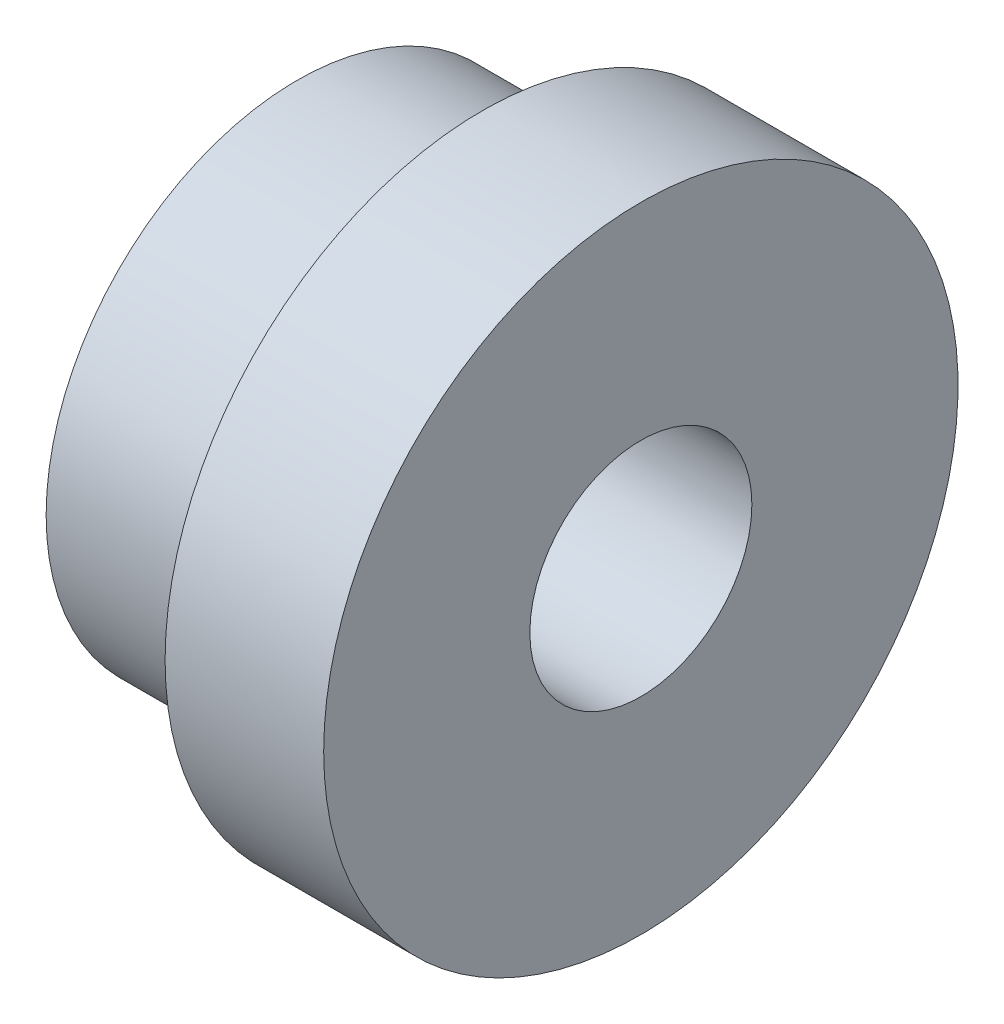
ISO-10303-21;
HEADER;
FILE_DESCRIPTION(('STEP AP214'),'2;1');
FILE_NAME('part.step','',(''),(''),'','','');
FILE_SCHEMA(('AUTOMOTIVE_DESIGN { 1 0 10303 214 1 1 1 1 }'));
ENDSEC;
DATA;
#1=APPLICATION_CONTEXT('core data for automotive mechanical design processes');
#2=APPLICATION_PROTOCOL_DEFINITION('international standard','automotive_design',2000,#1);
#3=PRODUCT_CONTEXT('',#1,'mechanical');
#4=PRODUCT('Part','Part','',(#3));
#5=PRODUCT_RELATED_PRODUCT_CATEGORY('part','',(#4));
#6=PRODUCT_DEFINITION_FORMATION('','',#4);
#7=PRODUCT_DEFINITION_CONTEXT('part definition',#1,'design');
#8=PRODUCT_DEFINITION('design','',#6,#7);
#9=PRODUCT_DEFINITION_SHAPE('','',#8);
#10=(LENGTH_UNIT() NAMED_UNIT(*) SI_UNIT(.MILLI.,.METRE.));
#11=(NAMED_UNIT(*) PLANE_ANGLE_UNIT() SI_UNIT($,.RADIAN.));
#12=(NAMED_UNIT(*) SI_UNIT($,.STERADIAN.) SOLID_ANGLE_UNIT());
#13=UNCERTAINTY_MEASURE_WITH_UNIT(LENGTH_MEASURE(1.E-05),#10,'distance_accuracy_value','');
#14=(GEOMETRIC_REPRESENTATION_CONTEXT(3) GLOBAL_UNCERTAINTY_ASSIGNED_CONTEXT((#13)) GLOBAL_UNIT_ASSIGNED_CONTEXT((#10,
#11,#12)) REPRESENTATION_CONTEXT('',''));
#15=CARTESIAN_POINT('',(0.,0.,0.));
#16=DIRECTION('',(0.,0.,1.));
#17=DIRECTION('',(1.,0.,0.));
#18=AXIS2_PLACEMENT_3D('',#15,#16,#17);
#19=CARTESIAN_POINT('',(0.,0.,-4.75));
#20=DIRECTION('',(1.,0.,0.));
#21=DIRECTION('',(0.,0.,-1.));
#22=AXIS2_PLACEMENT_3D('',#19,#20,#21);
#23=PLANE('',#22);
#24=CARTESIAN_POINT('',(0.,0.,0.));
#25=DIRECTION('',(1.,0.,0.));
#26=DIRECTION('',(0.,0.,-1.));
#27=AXIS2_PLACEMENT_3D('',#24,#25,#26);
#28=CIRCLE('',#27,2.1);
#29=CARTESIAN_POINT('',(0.,0.,-2.1));
#30=VERTEX_POINT('',#29);
#31=EDGE_CURVE('E48',#30,#30,#28,.T.);
#32=ORIENTED_EDGE('',*,*,#31,.T.);
#33=EDGE_LOOP('',(#32));
#34=FACE_BOUND('',#33,.T.);
#35=CARTESIAN_POINT('',(0.,0.,0.));
#36=DIRECTION('',(-1.,0.,0.));
#37=DIRECTION('',(0.,0.,1.));
#38=AXIS2_PLACEMENT_3D('',#35,#36,#37);
#39=CIRCLE('',#38,4.75);
#40=CARTESIAN_POINT('',(0.,0.,4.75));
#41=VERTEX_POINT('',#40);
#42=EDGE_CURVE('E43',#41,#41,#39,.T.);
#43=ORIENTED_EDGE('',*,*,#42,.T.);
#44=EDGE_LOOP('',(#43));
#45=FACE_BOUND('',#44,.T.);
#46=ADVANCED_FACE('F29',(#34,#45),#23,.F.);
#47=CARTESIAN_POINT('',(6.5,0.,0.));
#48=DIRECTION('',(-1.,0.,0.));
#49=DIRECTION('',(0.,0.,1.));
#50=AXIS2_PLACEMENT_3D('',#47,#48,#49);
#51=PLANE('',#50);
#52=CARTESIAN_POINT('',(6.5,0.,0.));
#53=DIRECTION('',(1.,0.,0.));
#54=DIRECTION('',(0.,0.,-1.));
#55=AXIS2_PLACEMENT_3D('',#52,#53,#54);
#56=CIRCLE('',#55,2.09999999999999);
#57=CARTESIAN_POINT('',(6.5,0.,-2.09999999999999));
#58=VERTEX_POINT('',#57);
#59=EDGE_CURVE('E51',#58,#58,#56,.T.);
#60=ORIENTED_EDGE('',*,*,#59,.F.);
#61=EDGE_LOOP('',(#60));
#62=FACE_BOUND('',#61,.T.);
#63=CARTESIAN_POINT('',(6.5,0.,0.));
#64=DIRECTION('',(-1.,0.,0.));
#65=DIRECTION('',(0.,0.,1.));
#66=AXIS2_PLACEMENT_3D('',#63,#64,#65);
#67=CIRCLE('',#66,6.);
#68=CARTESIAN_POINT('',(6.5,0.,6.));
#69=VERTEX_POINT('',#68);
#70=EDGE_CURVE('E10',#69,#69,#67,.T.);
#71=ORIENTED_EDGE('',*,*,#70,.F.);
#72=EDGE_LOOP('',(#71));
#73=FACE_BOUND('',#72,.T.);
#74=ADVANCED_FACE('F57',(#62,#73),#51,.F.);
#75=CARTESIAN_POINT('',(0.,0.,0.));
#76=DIRECTION('',(-1.,0.,0.));
#77=DIRECTION('',(0.,0.,1.));
#78=AXIS2_PLACEMENT_3D('',#75,#76,#77);
#79=CYLINDRICAL_SURFACE('',#78,6.);
#80=CARTESIAN_POINT('',(3.5,0.,0.));
#81=DIRECTION('',(-1.,0.,0.));
#82=DIRECTION('',(0.,0.,1.));
#83=AXIS2_PLACEMENT_3D('',#80,#81,#82);
#84=CIRCLE('',#83,6.);
#85=CARTESIAN_POINT('',(3.5,0.,6.));
#86=VERTEX_POINT('',#85);
#87=EDGE_CURVE('E35',#86,#86,#84,.T.);
#88=ORIENTED_EDGE('',*,*,#87,.F.);
#89=EDGE_LOOP('',(#88));
#90=FACE_BOUND('',#89,.T.);
#91=ORIENTED_EDGE('',*,*,#70,.T.);
#92=EDGE_LOOP('',(#91));
#93=FACE_BOUND('',#92,.T.);
#94=ADVANCED_FACE('F60',(#90,#93),#79,.T.);
#95=CARTESIAN_POINT('',(3.5,0.,-6.));
#96=DIRECTION('',(1.,0.,0.));
#97=DIRECTION('',(0.,0.,-1.));
#98=AXIS2_PLACEMENT_3D('',#95,#96,#97);
#99=PLANE('',#98);
#100=CARTESIAN_POINT('',(3.5,0.,0.));
#101=DIRECTION('',(-1.,0.,0.));
#102=DIRECTION('',(0.,0.,1.));
#103=AXIS2_PLACEMENT_3D('',#100,#101,#102);
#104=CIRCLE('',#103,4.75);
#105=CARTESIAN_POINT('',(3.5,0.,4.75));
#106=VERTEX_POINT('',#105);
#107=EDGE_CURVE('E39',#106,#106,#104,.T.);
#108=ORIENTED_EDGE('',*,*,#107,.F.);
#109=EDGE_LOOP('',(#108));
#110=FACE_BOUND('',#109,.T.);
#111=ORIENTED_EDGE('',*,*,#87,.T.);
#112=EDGE_LOOP('',(#111));
#113=FACE_BOUND('',#112,.T.);
#114=ADVANCED_FACE('F66',(#110,#113),#99,.F.);
#115=CARTESIAN_POINT('',(0.,0.,0.));
#116=DIRECTION('',(-1.,0.,0.));
#117=DIRECTION('',(0.,0.,1.));
#118=AXIS2_PLACEMENT_3D('',#115,#116,#117);
#119=CYLINDRICAL_SURFACE('',#118,4.75);
#120=ORIENTED_EDGE('',*,*,#42,.F.);
#121=EDGE_LOOP('',(#120));
#122=FACE_BOUND('',#121,.T.);
#123=ORIENTED_EDGE('',*,*,#107,.T.);
#124=EDGE_LOOP('',(#123));
#125=FACE_BOUND('',#124,.T.);
#126=ADVANCED_FACE('F73',(#122,#125),#119,.T.);
#127=CARTESIAN_POINT('',(6.5,0.,0.));
#128=DIRECTION('',(1.,0.,0.));
#129=DIRECTION('',(0.,0.,-1.));
#130=AXIS2_PLACEMENT_3D('',#127,#128,#129);
#131=CYLINDRICAL_SURFACE('',#130,2.09999999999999);
#132=ORIENTED_EDGE('',*,*,#31,.F.);
#133=EDGE_LOOP('',(#132));
#134=FACE_BOUND('',#133,.T.);
#135=ORIENTED_EDGE('',*,*,#59,.T.);
#136=EDGE_LOOP('',(#135));
#137=FACE_BOUND('',#136,.T.);
#138=ADVANCED_FACE('F55',(#134,#137),#131,.F.);
#139=CLOSED_SHELL('',(#46,#74,#94,#114,#126,#138));
#140=MANIFOLD_SOLID_BREP('B2',#139);
#141=ADVANCED_BREP_SHAPE_REPRESENTATION('',(#18,#140),#14);
#142=SHAPE_DEFINITION_REPRESENTATION(#9,#141);
ENDSEC;
END-ISO-10303-21;
